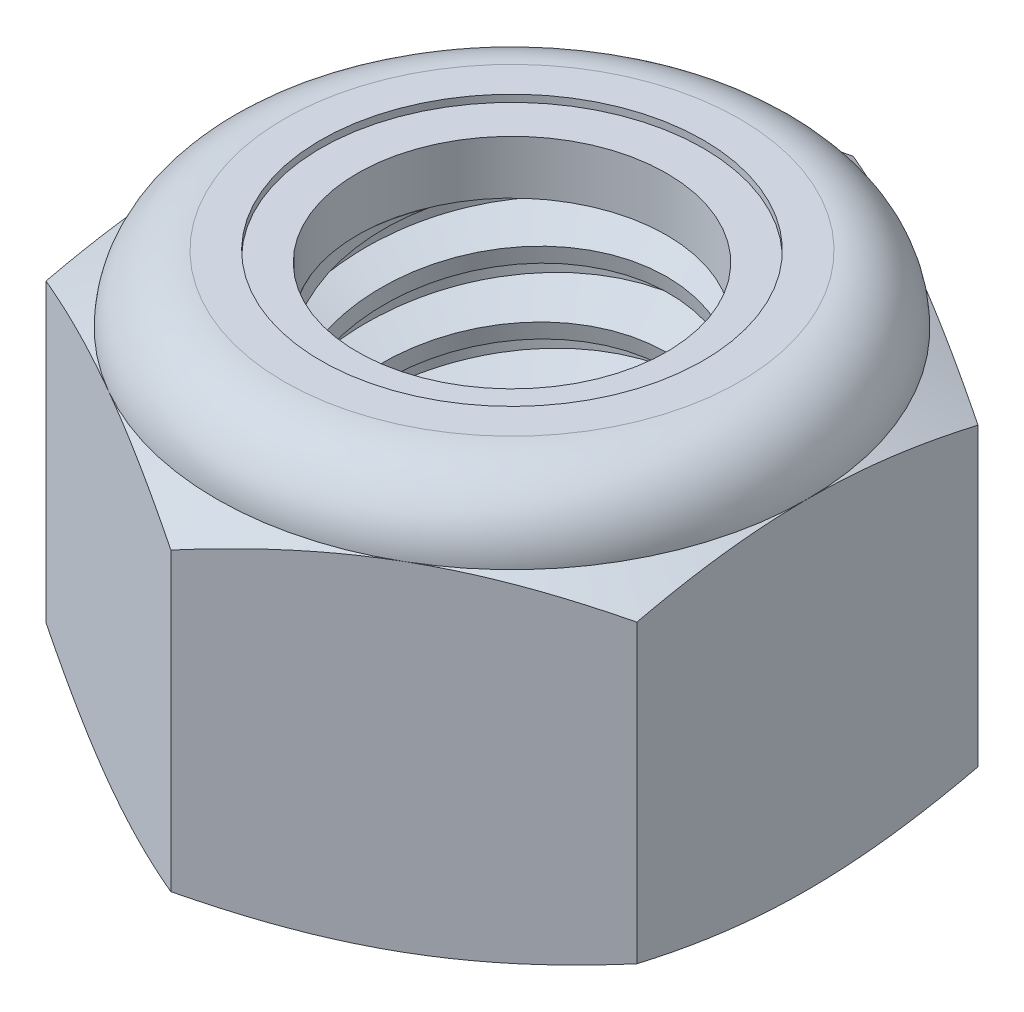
from build123d import *

# Parameters (mm, degrees)
EXTRUDE1_DEPTH      = 8.73125
SKETCH2_W           = 3.96875
SKETCH2_H           = 8.73125
LPATTERN1_COUNT     = 6
LPATTERN1_PITCH     = 1.411111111
LPATTERN1_COL_COUNT = 2
LPATTERN1_COL_PITCH = 1.411111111


with BuildPart() as part:
    # Sketch1 → Extrude1 (new body)
    with BuildSketch(Plane(origin=(0, 0, 0), x_dir=(1, 0, 0), z_dir=(0, 1, 0))):
        Polygon((0, 7.332348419), (-6.35, 3.666174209), (-6.35, -3.666174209), (0, -7.332348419), (6.35, -3.666174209), (6.35, 3.666174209), align=None)
    extrude(amount=EXTRUDE1_DEPTH)

    # Sketch4 → Cut-Revolve2 (revolve, cut)
    with BuildSketch(Plane(origin=(0, 0, 0), x_dir=(0, 0, -1), z_dir=(1, 0, 0)), mode=Mode.PRIVATE) as cut_revolve2_sk:
        Polygon((0, 8.73125), (3.96875, 8.73125), (3.324813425, 8.430977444), (3.324813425, 0.300272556), (3.96875, 0), (0, 0), align=None)
    revolve(cut_revolve2_sk.sketch.rotate(Axis((0, 8.73125, 0), (0, 1, 0)), 54.613771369), axis=Axis((0, 8.73125, 0), (0, 1, 0)), mode=Mode.SUBTRACT)


with BuildPart() as body_2:
    # Sketch2 → Revolve1 (revolve)
    with BuildSketch(Plane(origin=(0, 0, 0), x_dir=(0, 0, -1), z_dir=(1, 0, 0))):
        with Locations((1.984375, 4.365625)):
            Rectangle(SKETCH2_W, SKETCH2_H)
    revolve(axis=Axis((0, -3.96875, 0), (0, 1, 0)))

    # Sketch3 → Cut-Revolve1 (revolve, cut)
    with BuildSketch(Plane(origin=(0, 0, 0), x_dir=(0, 0, -1), z_dir=(1, 0, 0)), mode=Mode.PRIVATE) as cut_revolve1_sk:
        Polygon((3.999623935, 8.557584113), (4.215741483, 7.341922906), (3.386561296, 7.642399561), (3.324813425, 7.989731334), align=None)
    cut_revolve1 = revolve(cut_revolve1_sk.sketch.rotate(Axis((0, 8.73125, 0.268755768), (0, -0.9845625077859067, -0.17503333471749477)), 180), axis=Axis((0, 8.73125, 0.268755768), (0, -0.9845625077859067, -0.17503333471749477)), mode=Mode.SUBTRACT)

    # LPattern1: Cut-Revolve1 ×6
    with Locations(*[(0, -i * LPATTERN1_PITCH, 0) for i in range(1, LPATTERN1_COUNT)]):
        add(cut_revolve1, mode=Mode.SUBTRACT)

    # LPattern1 col: Cut-Revolve1 ×2
    with Locations(*[(0, i * LPATTERN1_COL_PITCH, 0) for i in range(1, LPATTERN1_COL_COUNT)]):
        add(cut_revolve1, mode=Mode.SUBTRACT)


with BuildPart() as part_1:
    add(part.part)

    # Combine1: cut body 2
    add(body_2.part, mode=Mode.SUBTRACT)

    # Sketch5 → Cut-Revolve3 (revolve, cut)
    with BuildSketch(Plane(origin=(0, 0, 0), x_dir=(0, 0, -1), z_dir=(1, 0, 0)), mode=Mode.PRIVATE) as cut_revolve3_sk:
        with BuildLine():
            Line((0, 0), (6.35, 0))
            Line((6.35, 0), (7.332348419, 0.458076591))
            Line((7.332348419, 0.458076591), (7.332348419, 6.817965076))
            Line((7.332348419, 6.817965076), (6.35, 7.276041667))
            ThreePointArc((6.35, 7.276041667), (5.923779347, 8.305029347), (4.894791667, 8.73125))
            Line((4.894791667, 8.73125), (4.894791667, 10.00125))
            Line((4.894791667, 10.00125), (8.602348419, 10.00125))
            Line((8.602348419, 10.00125), (8.602348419, -1.27))
            Line((8.602348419, -1.27), (0, -1.27))
            Line((0, -1.27), (0, 0))
        make_face()
    revolve(cut_revolve3_sk.sketch.rotate(Axis((0, 0, 0), (0, 1, 0)), 54.613771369), axis=Axis((0, 0, 0), (0, 1, 0)), mode=Mode.SUBTRACT)

    # Sketch6 → Cut-Revolve4 (revolve, cut)
    with BuildSketch(Plane(origin=(0, 0, 0), x_dir=(0, 0, -1), z_dir=(1, 0, 0)), mode=Mode.PRIVATE) as cut_revolve4_sk:
        with BuildLine():
            Line((0, 7.276041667), (6.1976, 7.276041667))
            ThreePointArc((6.1976, 7.276041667), (5.816016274, 8.197266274), (4.894791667, 8.57885))
            Line((4.894791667, 8.57885), (4.109802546, 8.57885))
            Line((4.109802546, 8.57885), (4.109802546, 10.00125))
            Line((4.109802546, 10.00125), (0, 10.00125))
            Line((0, 10.00125), (0, 7.276041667))
        make_face()
    revolve(cut_revolve4_sk.sketch.rotate(Axis((0, 10.00125, 0), (0, 1, 0)), 54.613771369), axis=Axis((0, 10.00125, 0), (0, 1, 0)), mode=Mode.SUBTRACT)


with BuildPart() as body_2_2:
    # Sketch7 → Revolve2 (revolve)
    with BuildSketch(Plane(origin=(0, 0, 0), x_dir=(0, 0, -1), z_dir=(1, 0, 0))):
        with BuildLine():
            Line((3.324813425, 7.352241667), (6.119030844, 7.352241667))
            ThreePointArc((6.119030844, 7.352241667), (5.734762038, 8.169919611), (4.894791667, 8.50265))
            Line((4.894791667, 8.50265), (3.324813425, 8.50265))
            Line((3.324813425, 8.50265), (3.324813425, 7.352241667))
        make_face()
    revolve(axis=Axis((0, 7.352241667, 0), (0, 1, 0)))


solid = Compound([part_1.part, body_2_2.part])
